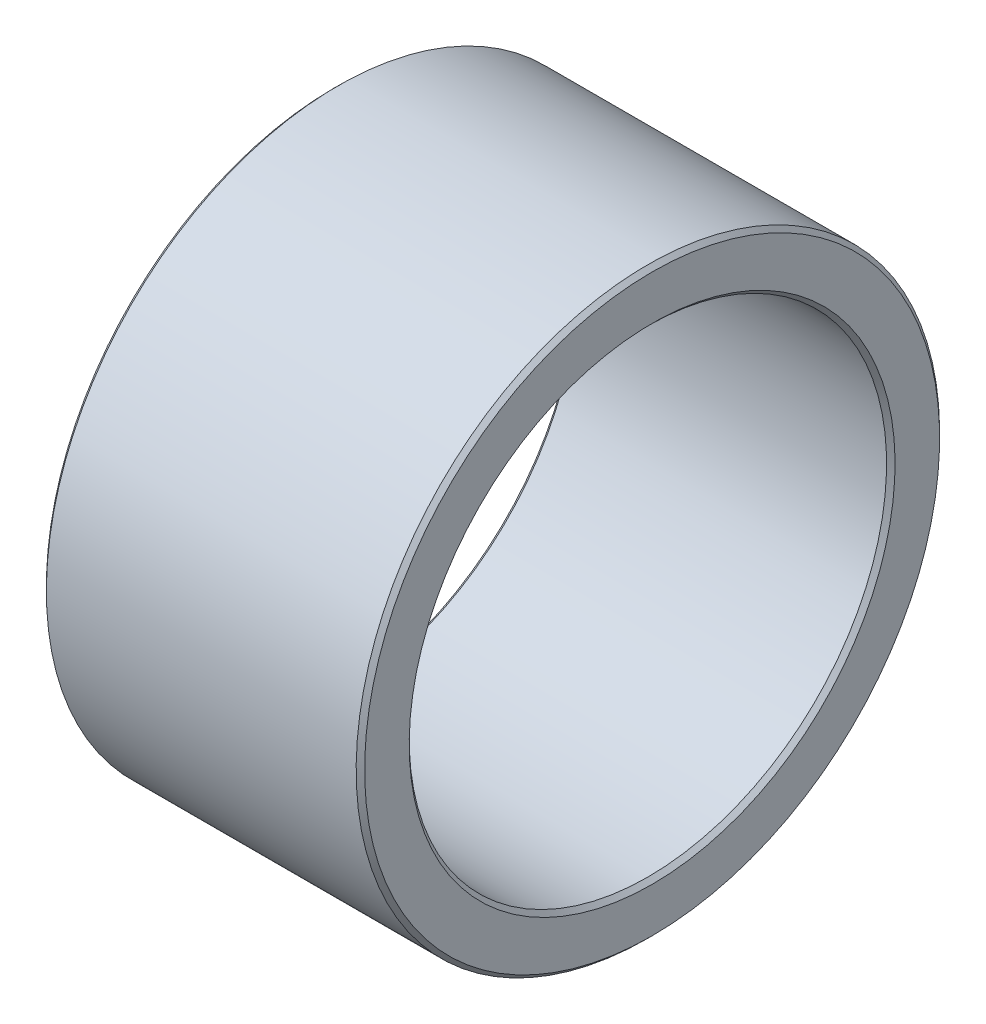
ISO-10303-21;
HEADER;
FILE_DESCRIPTION(('STEP AP214'),'2;1');
FILE_NAME('part.step','',(''),(''),'','','');
FILE_SCHEMA(('AUTOMOTIVE_DESIGN { 1 0 10303 214 1 1 1 1 }'));
ENDSEC;
DATA;
#1=APPLICATION_CONTEXT('core data for automotive mechanical design processes');
#2=APPLICATION_PROTOCOL_DEFINITION('international standard','automotive_design',2000,#1);
#3=PRODUCT_CONTEXT('',#1,'mechanical');
#4=PRODUCT('Part','Part','',(#3));
#5=PRODUCT_RELATED_PRODUCT_CATEGORY('part','',(#4));
#6=PRODUCT_DEFINITION_FORMATION('','',#4);
#7=PRODUCT_DEFINITION_CONTEXT('part definition',#1,'design');
#8=PRODUCT_DEFINITION('design','',#6,#7);
#9=PRODUCT_DEFINITION_SHAPE('','',#8);
#10=(LENGTH_UNIT() NAMED_UNIT(*) SI_UNIT(.MILLI.,.METRE.));
#11=(NAMED_UNIT(*) PLANE_ANGLE_UNIT() SI_UNIT($,.RADIAN.));
#12=(NAMED_UNIT(*) SI_UNIT($,.STERADIAN.) SOLID_ANGLE_UNIT());
#13=UNCERTAINTY_MEASURE_WITH_UNIT(LENGTH_MEASURE(1.E-05),#10,'distance_accuracy_value','');
#14=(GEOMETRIC_REPRESENTATION_CONTEXT(3) GLOBAL_UNCERTAINTY_ASSIGNED_CONTEXT((#13)) GLOBAL_UNIT_ASSIGNED_CONTEXT((#10,
#11,#12)) REPRESENTATION_CONTEXT('',''));
#15=CARTESIAN_POINT('',(0.,0.,0.));
#16=DIRECTION('',(0.,0.,1.));
#17=DIRECTION('',(1.,0.,0.));
#18=AXIS2_PLACEMENT_3D('',#15,#16,#17);
#19=CARTESIAN_POINT('',(0.,-25.,0.));
#20=DIRECTION('',(-1.,0.,0.));
#21=DIRECTION('',(0.,1.,0.));
#22=AXIS2_PLACEMENT_3D('',#19,#20,#21);
#23=PLANE('',#22);
#24=CARTESIAN_POINT('',(0.,0.,0.));
#25=DIRECTION('',(1.,0.,0.));
#26=DIRECTION('',(0.,-1.,0.));
#27=AXIS2_PLACEMENT_3D('',#24,#25,#26);
#28=CIRCLE('',#27,22.9);
#29=CARTESIAN_POINT('',(0.,-22.9,0.));
#30=VERTEX_POINT('',#29);
#31=EDGE_CURVE('E9',#30,#30,#28,.T.);
#32=ORIENTED_EDGE('',*,*,#31,.T.);
#33=EDGE_LOOP('',(#32));
#34=FACE_BOUND('',#33,.T.);
#35=CARTESIAN_POINT('',(0.,0.,0.));
#36=DIRECTION('',(1.,0.,0.));
#37=DIRECTION('',(0.,-1.,0.));
#38=AXIS2_PLACEMENT_3D('',#35,#36,#37);
#39=CIRCLE('',#38,27.1);
#40=CARTESIAN_POINT('',(0.,-27.1,0.));
#41=VERTEX_POINT('',#40);
#42=EDGE_CURVE('E53',#41,#41,#39,.T.);
#43=ORIENTED_EDGE('',*,*,#42,.F.);
#44=EDGE_LOOP('',(#43));
#45=FACE_BOUND('',#44,.T.);
#46=ADVANCED_FACE('F15',(#34,#45),#23,.T.);
#47=CARTESIAN_POINT('',(0.2,0.,0.));
#48=DIRECTION('',(-1.,0.,0.));
#49=DIRECTION('',(0.,-1.,0.));
#50=AXIS2_PLACEMENT_3D('',#47,#48,#49);
#51=CONICAL_SURFACE('',#50,22.7,0.78539816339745);
#52=CARTESIAN_POINT('',(0.4,0.,0.));
#53=DIRECTION('',(1.,0.,0.));
#54=DIRECTION('',(0.,-1.,0.));
#55=AXIS2_PLACEMENT_3D('',#52,#53,#54);
#56=CIRCLE('',#55,22.5);
#57=CARTESIAN_POINT('',(0.4,-22.5,0.));
#58=VERTEX_POINT('',#57);
#59=EDGE_CURVE('E22',#58,#58,#56,.T.);
#60=ORIENTED_EDGE('',*,*,#59,.T.);
#61=EDGE_LOOP('',(#60));
#62=FACE_BOUND('',#61,.T.);
#63=ORIENTED_EDGE('',*,*,#31,.F.);
#64=EDGE_LOOP('',(#63));
#65=FACE_BOUND('',#64,.T.);
#66=ADVANCED_FACE('F82',(#62,#65),#51,.F.);
#67=CARTESIAN_POINT('',(15.,0.,0.));
#68=DIRECTION('',(-1.,0.,0.));
#69=DIRECTION('',(0.,-1.,0.));
#70=AXIS2_PLACEMENT_3D('',#67,#68,#69);
#71=CYLINDRICAL_SURFACE('',#70,22.5);
#72=CARTESIAN_POINT('',(29.6,0.,0.));
#73=DIRECTION('',(1.,0.,0.));
#74=DIRECTION('',(0.,-1.,0.));
#75=AXIS2_PLACEMENT_3D('',#72,#73,#74);
#76=CIRCLE('',#75,22.5);
#77=CARTESIAN_POINT('',(29.6,-22.5,0.));
#78=VERTEX_POINT('',#77);
#79=EDGE_CURVE('E58',#78,#78,#76,.T.);
#80=ORIENTED_EDGE('',*,*,#79,.T.);
#81=EDGE_LOOP('',(#80));
#82=FACE_BOUND('',#81,.T.);
#83=ORIENTED_EDGE('',*,*,#59,.F.);
#84=EDGE_LOOP('',(#83));
#85=FACE_BOUND('',#84,.T.);
#86=ADVANCED_FACE('F66',(#82,#85),#71,.F.);
#87=CARTESIAN_POINT('',(29.8,0.,0.));
#88=DIRECTION('',(1.,0.,0.));
#89=DIRECTION('',(0.,-1.,0.));
#90=AXIS2_PLACEMENT_3D('',#87,#88,#89);
#91=CONICAL_SURFACE('',#90,22.7,0.785398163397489);
#92=CARTESIAN_POINT('',(30.,0.,0.));
#93=DIRECTION('',(1.,0.,0.));
#94=DIRECTION('',(0.,-1.,0.));
#95=AXIS2_PLACEMENT_3D('',#92,#93,#94);
#96=CIRCLE('',#95,22.9);
#97=CARTESIAN_POINT('',(30.,-22.9,0.));
#98=VERTEX_POINT('',#97);
#99=EDGE_CURVE('E63',#98,#98,#96,.T.);
#100=ORIENTED_EDGE('',*,*,#99,.T.);
#101=EDGE_LOOP('',(#100));
#102=FACE_BOUND('',#101,.T.);
#103=ORIENTED_EDGE('',*,*,#79,.F.);
#104=EDGE_LOOP('',(#103));
#105=FACE_BOUND('',#104,.T.);
#106=ADVANCED_FACE('F69',(#102,#105),#91,.F.);
#107=CARTESIAN_POINT('',(30.,-25.,0.));
#108=DIRECTION('',(1.,0.,0.));
#109=DIRECTION('',(0.,-1.,0.));
#110=AXIS2_PLACEMENT_3D('',#107,#108,#109);
#111=PLANE('',#110);
#112=CARTESIAN_POINT('',(30.,0.,0.));
#113=DIRECTION('',(1.,0.,0.));
#114=DIRECTION('',(0.,-1.,0.));
#115=AXIS2_PLACEMENT_3D('',#112,#113,#114);
#116=CIRCLE('',#115,27.1);
#117=CARTESIAN_POINT('',(30.,-27.1,0.));
#118=VERTEX_POINT('',#117);
#119=EDGE_CURVE('E61',#118,#118,#116,.T.);
#120=ORIENTED_EDGE('',*,*,#119,.T.);
#121=EDGE_LOOP('',(#120));
#122=FACE_BOUND('',#121,.T.);
#123=ORIENTED_EDGE('',*,*,#99,.F.);
#124=EDGE_LOOP('',(#123));
#125=FACE_BOUND('',#124,.T.);
#126=ADVANCED_FACE('F71',(#122,#125),#111,.T.);
#127=CARTESIAN_POINT('',(29.8,0.,0.));
#128=DIRECTION('',(-1.,0.,0.));
#129=DIRECTION('',(0.,-1.,0.));
#130=AXIS2_PLACEMENT_3D('',#127,#128,#129);
#131=CONICAL_SURFACE('',#130,27.3,0.785398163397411);
#132=CARTESIAN_POINT('',(29.6,0.,0.));
#133=DIRECTION('',(1.,0.,0.));
#134=DIRECTION('',(0.,-1.,0.));
#135=AXIS2_PLACEMENT_3D('',#132,#133,#134);
#136=CIRCLE('',#135,27.5);
#137=CARTESIAN_POINT('',(29.6,-27.5,0.));
#138=VERTEX_POINT('',#137);
#139=EDGE_CURVE('E55',#138,#138,#136,.T.);
#140=ORIENTED_EDGE('',*,*,#139,.T.);
#141=EDGE_LOOP('',(#140));
#142=FACE_BOUND('',#141,.T.);
#143=ORIENTED_EDGE('',*,*,#119,.F.);
#144=EDGE_LOOP('',(#143));
#145=FACE_BOUND('',#144,.T.);
#146=ADVANCED_FACE('F79',(#142,#145),#131,.T.);
#147=CARTESIAN_POINT('',(15.,0.,0.));
#148=DIRECTION('',(-1.,0.,0.));
#149=DIRECTION('',(0.,-1.,0.));
#150=AXIS2_PLACEMENT_3D('',#147,#148,#149);
#151=CYLINDRICAL_SURFACE('',#150,27.5);
#152=CARTESIAN_POINT('',(0.4,0.,0.));
#153=DIRECTION('',(1.,0.,0.));
#154=DIRECTION('',(0.,-1.,0.));
#155=AXIS2_PLACEMENT_3D('',#152,#153,#154);
#156=CIRCLE('',#155,27.5);
#157=CARTESIAN_POINT('',(0.4,-27.5,0.));
#158=VERTEX_POINT('',#157);
#159=EDGE_CURVE('E49',#158,#158,#156,.T.);
#160=ORIENTED_EDGE('',*,*,#159,.T.);
#161=EDGE_LOOP('',(#160));
#162=FACE_BOUND('',#161,.T.);
#163=ORIENTED_EDGE('',*,*,#139,.F.);
#164=EDGE_LOOP('',(#163));
#165=FACE_BOUND('',#164,.T.);
#166=ADVANCED_FACE('F50',(#162,#165),#151,.T.);
#167=CARTESIAN_POINT('',(0.2,0.,0.));
#168=DIRECTION('',(1.,0.,0.));
#169=DIRECTION('',(0.,-1.,0.));
#170=AXIS2_PLACEMENT_3D('',#167,#168,#169);
#171=CONICAL_SURFACE('',#170,27.3,0.785398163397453);
#172=ORIENTED_EDGE('',*,*,#42,.T.);
#173=EDGE_LOOP('',(#172));
#174=FACE_BOUND('',#173,.T.);
#175=ORIENTED_EDGE('',*,*,#159,.F.);
#176=EDGE_LOOP('',(#175));
#177=FACE_BOUND('',#176,.T.);
#178=ADVANCED_FACE('F92',(#174,#177),#171,.T.);
#179=CLOSED_SHELL('',(#46,#66,#86,#106,#126,#146,#166,#178));
#180=MANIFOLD_SOLID_BREP('B1',#179);
#181=ADVANCED_BREP_SHAPE_REPRESENTATION('',(#18,#180),#14);
#182=SHAPE_DEFINITION_REPRESENTATION(#9,#181);
ENDSEC;
END-ISO-10303-21;
